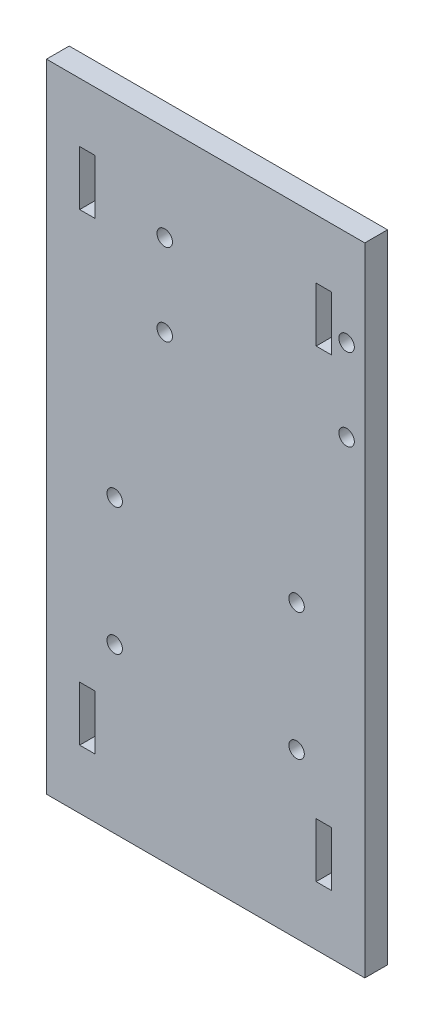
from build123d import *

# Parameters (mm, degrees)
SKETCH_1_W                                          = 70
SKETCH_1_H                                          = 140
BASE_70X140X5_DEPTH                                 = 5
CHASSIS_ADJUSTMENT_SLOTS_UNVERIFIED_POSI_DEPTH      = 79.421935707
CHASSIS_ADJUSTMENT_SLOTS_UNVERIFIED_POSI_DEPTH_BACK = 79.421935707
SKETCH_2_W                                          = 3.4
SKETCH_2_H                                          = 12
SUPPORT_AND_SERVO_MOUNT_M3_CLEARANCE_DEPTH          = 79.421935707
SUPPORT_AND_SERVO_MOUNT_M3_CLEARANCE_DEPTH_BACK     = 79.421935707
SKETCH_3_R                                          = 1.7


with BuildPart() as part:
    # Sketch 1 → Base_70x140x5 (new body)
    with BuildSketch(Plane.XY):
        Rectangle(SKETCH_1_W, SKETCH_1_H)
    extrude(amount=BASE_70X140X5_DEPTH)

    # Sketch 2 → Chassis_adjustment_slots_UNVERIFIED_posi (cut, two sides: drawn at the far end of the back side and taken through both)
    with BuildSketch(Plane.XY.offset(-CHASSIS_ADJUSTMENT_SLOTS_UNVERIFIED_POSI_DEPTH_BACK)):
        with Locations((-26, -51)):
            Rectangle(SKETCH_2_W, SKETCH_2_H)
        with Locations((-26, 51)):
            Rectangle(SKETCH_2_W, SKETCH_2_H)
        with Locations((26, -51)):
            Rectangle(SKETCH_2_W, SKETCH_2_H)
        with Locations((26, 51)):
            Rectangle(SKETCH_2_W, SKETCH_2_H)
    extrude(amount=CHASSIS_ADJUSTMENT_SLOTS_UNVERIFIED_POSI_DEPTH + CHASSIS_ADJUSTMENT_SLOTS_UNVERIFIED_POSI_DEPTH_BACK, mode=Mode.SUBTRACT)

    # Sketch 3 → Support_and_servo_mount_M3_clearance (cut, two sides: drawn at the far end of the back side and taken through both)
    with BuildSketch(Plane.XY.offset(-SUPPORT_AND_SERVO_MOUNT_M3_CLEARANCE_DEPTH_BACK)):
        with Locations((-20, -34)):
            Circle(SKETCH_3_R)
        with Locations((-20, -6)):
            Circle(SKETCH_3_R)
        with Locations((20, -34)):
            Circle(SKETCH_3_R)
        with Locations((20, -6)):
            Circle(SKETCH_3_R)
        with Locations((-9, 31)):
            Circle(SKETCH_3_R)
        with Locations((-9, 49)):
            Circle(SKETCH_3_R)
        with Locations((31, 31)):
            Circle(SKETCH_3_R)
        with Locations((31, 49)):
            Circle(SKETCH_3_R)
    extrude(amount=SUPPORT_AND_SERVO_MOUNT_M3_CLEARANCE_DEPTH + SUPPORT_AND_SERVO_MOUNT_M3_CLEARANCE_DEPTH_BACK, mode=Mode.SUBTRACT)


solid = part.part
